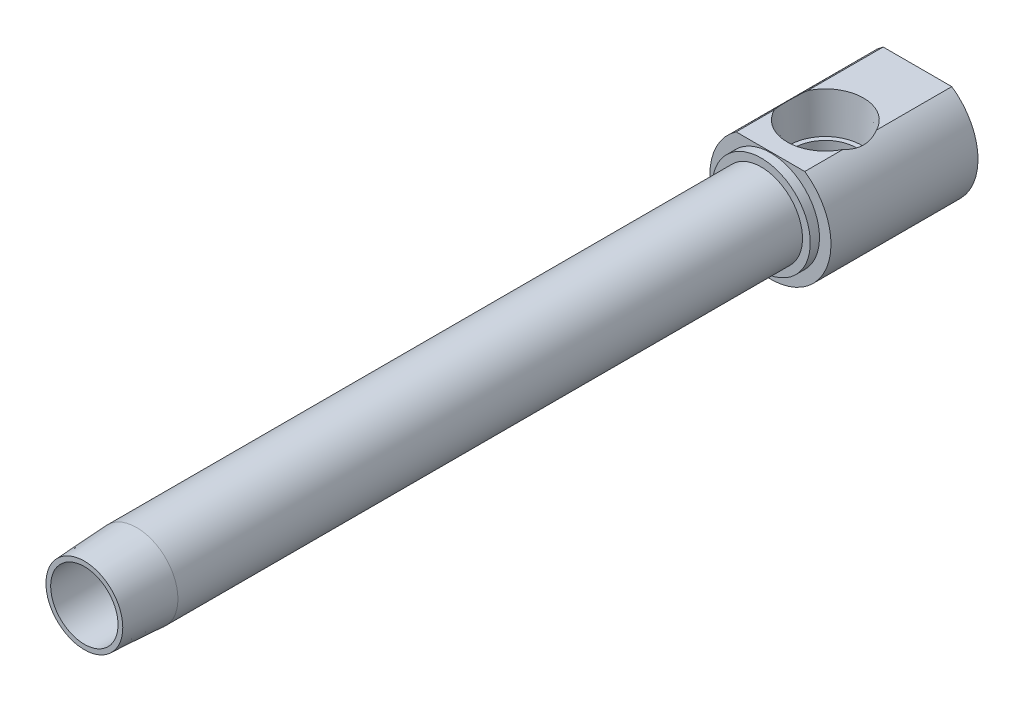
ISO-10303-21;
HEADER;
FILE_DESCRIPTION(('STEP AP214'),'2;1');
FILE_NAME('part.step','',(''),(''),'','','');
FILE_SCHEMA(('AUTOMOTIVE_DESIGN { 1 0 10303 214 1 1 1 1 }'));
ENDSEC;
DATA;
#1=APPLICATION_CONTEXT('core data for automotive mechanical design processes');
#2=APPLICATION_PROTOCOL_DEFINITION('international standard','automotive_design',2000,#1);
#3=PRODUCT_CONTEXT('',#1,'mechanical');
#4=PRODUCT('Part','Part','',(#3));
#5=PRODUCT_RELATED_PRODUCT_CATEGORY('part','',(#4));
#6=PRODUCT_DEFINITION_FORMATION('','',#4);
#7=PRODUCT_DEFINITION_CONTEXT('part definition',#1,'design');
#8=PRODUCT_DEFINITION('design','',#6,#7);
#9=PRODUCT_DEFINITION_SHAPE('','',#8);
#10=(LENGTH_UNIT() NAMED_UNIT(*) SI_UNIT(.MILLI.,.METRE.));
#11=(NAMED_UNIT(*) PLANE_ANGLE_UNIT() SI_UNIT($,.RADIAN.));
#12=(NAMED_UNIT(*) SI_UNIT($,.STERADIAN.) SOLID_ANGLE_UNIT());
#13=UNCERTAINTY_MEASURE_WITH_UNIT(LENGTH_MEASURE(1.E-05),#10,'distance_accuracy_value','');
#14=(GEOMETRIC_REPRESENTATION_CONTEXT(3) GLOBAL_UNCERTAINTY_ASSIGNED_CONTEXT((#13)) GLOBAL_UNIT_ASSIGNED_CONTEXT((#10,
#11,#12)) REPRESENTATION_CONTEXT('',''));
#15=CARTESIAN_POINT('',(0.,0.,0.));
#16=DIRECTION('',(0.,0.,1.));
#17=DIRECTION('',(1.,0.,0.));
#18=AXIS2_PLACEMENT_3D('',#15,#16,#17);
#19=CARTESIAN_POINT('',(0.,0.,-233.947166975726));
#20=DIRECTION('',(0.,0.,-1.));
#21=DIRECTION('',(-1.,0.,0.));
#22=AXIS2_PLACEMENT_3D('',#19,#20,#21);
#23=CYLINDRICAL_SURFACE('',#22,10.6883167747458);
#24=CARTESIAN_POINT('',(0.,0.,-175.4124));
#25=DIRECTION('',(0.,0.,-1.));
#26=DIRECTION('',(-1.,0.,0.));
#27=AXIS2_PLACEMENT_3D('',#24,#25,#26);
#28=CIRCLE('',#27,10.6883167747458);
#29=CARTESIAN_POINT('',(-10.6883167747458,0.,-175.4124));
#30=VERTEX_POINT('',#29);
#31=EDGE_CURVE('E143',#30,#30,#28,.T.);
#32=ORIENTED_EDGE('',*,*,#31,.F.);
#33=EDGE_LOOP('',(#32));
#34=FACE_BOUND('',#33,.T.);
#35=CARTESIAN_POINT('',(0.,0.,-13.5636));
#36=DIRECTION('',(0.,0.,1.));
#37=DIRECTION('',(1.,0.,0.));
#38=AXIS2_PLACEMENT_3D('',#35,#36,#37);
#39=CIRCLE('',#38,10.6883167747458);
#40=CARTESIAN_POINT('',(10.6883167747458,0.,-13.5636));
#41=VERTEX_POINT('',#40);
#42=EDGE_CURVE('E229',#41,#41,#39,.T.);
#43=ORIENTED_EDGE('',*,*,#42,.F.);
#44=EDGE_LOOP('',(#43));
#45=FACE_BOUND('',#44,.T.);
#46=ADVANCED_FACE('F15',(#34,#45),#23,.T.);
#47=CARTESIAN_POINT('',(-8.73125000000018,0.,0.));
#48=DIRECTION('',(0.,0.,1.));
#49=DIRECTION('',(1.,0.,0.));
#50=AXIS2_PLACEMENT_3D('',#47,#48,#49);
#51=PLANE('',#50);
#52=CARTESIAN_POINT('',(0.,0.,0.));
#53=DIRECTION('',(0.,0.,-1.));
#54=DIRECTION('',(-1.,0.,0.));
#55=AXIS2_PLACEMENT_3D('',#52,#53,#54);
#56=CIRCLE('',#55,8.73125000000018);
#57=CARTESIAN_POINT('',(-8.73125000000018,0.,0.));
#58=VERTEX_POINT('',#57);
#59=EDGE_CURVE('E19',#58,#58,#56,.T.);
#60=ORIENTED_EDGE('',*,*,#59,.T.);
#61=EDGE_LOOP('',(#60));
#62=FACE_BOUND('',#61,.T.);
#63=CARTESIAN_POINT('',(0.,0.,0.));
#64=DIRECTION('',(0.,0.,1.));
#65=DIRECTION('',(1.,0.,0.));
#66=AXIS2_PLACEMENT_3D('',#63,#64,#65);
#67=CIRCLE('',#66,9.9568);
#68=CARTESIAN_POINT('',(9.9568,0.,0.));
#69=VERTEX_POINT('',#68);
#70=EDGE_CURVE('E231',#69,#69,#67,.T.);
#71=ORIENTED_EDGE('',*,*,#70,.T.);
#72=EDGE_LOOP('',(#71));
#73=FACE_BOUND('',#72,.T.);
#74=ADVANCED_FACE('F17',(#62,#73),#51,.T.);
#75=CARTESIAN_POINT('',(-8.89,12.9217429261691,-158.75));
#76=DIRECTION('',(0.,-1.,0.));
#77=DIRECTION('',(0.,0.,-1.));
#78=AXIS2_PLACEMENT_3D('',#75,#76,#77);
#79=PLANE('',#78);
#80=DIRECTION('',(0.,0.,-1.));
#81=VECTOR('',#80,1.);
#82=CARTESIAN_POINT('',(8.89,12.9217429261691,-158.75));
#83=LINE('',#82,#81);
#84=CARTESIAN_POINT('',(8.89,12.9217429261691,-177.8));
#85=VERTEX_POINT('',#84);
#86=CARTESIAN_POINT('',(8.89,12.9217429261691,-187.698054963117));
#87=VERTEX_POINT('',#86);
#88=EDGE_CURVE('E127',#85,#87,#83,.T.);
#89=ORIENTED_EDGE('',*,*,#88,.T.);
#90=CARTESIAN_POINT('',(0.,12.9217429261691,-192.024));
#91=DIRECTION('',(0.,-1.,0.));
#92=DIRECTION('',(0.,0.,-1.));
#93=AXIS2_PLACEMENT_3D('',#90,#91,#92);
#94=CIRCLE('',#93,9.88665264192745);
#95=CARTESIAN_POINT('',(-8.89,12.9217429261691,-187.698054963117));
#96=VERTEX_POINT('',#95);
#97=EDGE_CURVE('E111',#87,#96,#94,.T.);
#98=ORIENTED_EDGE('',*,*,#97,.T.);
#99=DIRECTION('',(0.,0.,-1.));
#100=VECTOR('',#99,1.);
#101=CARTESIAN_POINT('',(-8.89,12.9217429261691,-158.75));
#102=LINE('',#101,#100);
#103=CARTESIAN_POINT('',(-8.89,12.9217429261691,-177.8));
#104=VERTEX_POINT('',#103);
#105=EDGE_CURVE('E138',#104,#96,#102,.T.);
#106=ORIENTED_EDGE('',*,*,#105,.F.);
#107=DIRECTION('',(1.,0.,0.));
#108=VECTOR('',#107,1.);
#109=CARTESIAN_POINT('',(-12.7,12.9217429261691,-177.8));
#110=LINE('',#109,#108);
#111=EDGE_CURVE('E135',#104,#85,#110,.T.);
#112=ORIENTED_EDGE('',*,*,#111,.T.);
#113=EDGE_LOOP('',(#89,#98,#106,#112));
#114=FACE_BOUND('',#113,.T.);
#115=ADVANCED_FACE('F133',(#114),#79,.F.);
#116=CARTESIAN_POINT('',(-8.73125000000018,0.,-175.827796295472));
#117=DIRECTION('',(0.,0.,1.));
#118=DIRECTION('',(1.,0.,0.));
#119=AXIS2_PLACEMENT_3D('',#116,#117,#118);
#120=PLANE('',#119);
#121=CARTESIAN_POINT('',(0.,0.,-175.827796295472));
#122=DIRECTION('',(0.,0.,-1.));
#123=DIRECTION('',(-1.,0.,0.));
#124=AXIS2_PLACEMENT_3D('',#121,#122,#123);
#125=CIRCLE('',#124,8.73125000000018);
#126=CARTESIAN_POINT('',(-8.73125000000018,0.,-175.827796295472));
#127=VERTEX_POINT('',#126);
#128=EDGE_CURVE('E157',#127,#127,#125,.T.);
#129=ORIENTED_EDGE('',*,*,#128,.F.);
#130=EDGE_LOOP('',(#129));
#131=FACE_BOUND('',#130,.T.);
#132=CARTESIAN_POINT('',(0.,-1.53831558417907,-175.827796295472));
#133=DIRECTION('',(0.,0.,1.));
#134=DIRECTION('',(0.,1.,0.));
#135=AXIS2_PLACEMENT_3D('',#132,#133,#134);
#136=ELLIPSE('',#135,7.0682508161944,6.80767250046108);
#137=CARTESIAN_POINT('',(0.,5.52993523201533,-175.827796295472));
#138=VERTEX_POINT('',#137);
#139=EDGE_CURVE('E162',#138,#138,#136,.F.);
#140=ORIENTED_EDGE('',*,*,#139,.T.);
#141=EDGE_LOOP('',(#140));
#142=FACE_BOUND('',#141,.T.);
#143=ADVANCED_FACE('F211',(#131,#142),#120,.T.);
#144=CARTESIAN_POINT('',(0.,0.,-233.947166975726));
#145=DIRECTION('',(0.,0.,-1.));
#146=DIRECTION('',(-1.,0.,0.));
#147=AXIS2_PLACEMENT_3D('',#144,#145,#146);
#148=CYLINDRICAL_SURFACE('',#147,8.73125000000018);
#149=ORIENTED_EDGE('',*,*,#128,.T.);
#150=EDGE_LOOP('',(#149));
#151=FACE_BOUND('',#150,.T.);
#152=ORIENTED_EDGE('',*,*,#59,.F.);
#153=EDGE_LOOP('',(#152));
#154=FACE_BOUND('',#153,.T.);
#155=ADVANCED_FACE('F209',(#151,#154),#148,.F.);
#156=CARTESIAN_POINT('',(-15.6845,0.,-215.9));
#157=DIRECTION('',(0.,0.,-1.));
#158=DIRECTION('',(-1.,0.,0.));
#159=AXIS2_PLACEMENT_3D('',#156,#157,#158);
#160=PLANE('',#159);
#161=DIRECTION('',(1.,0.,0.));
#162=VECTOR('',#161,1.);
#163=CARTESIAN_POINT('',(-3.66617420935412,6.35,-215.9));
#164=LINE('',#163,#162);
#165=CARTESIAN_POINT('',(-3.66617420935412,6.35,-215.9));
#166=VERTEX_POINT('',#165);
#167=CARTESIAN_POINT('',(3.66617420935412,6.35,-215.9));
#168=VERTEX_POINT('',#167);
#169=EDGE_CURVE('E165',#166,#168,#164,.T.);
#170=ORIENTED_EDGE('',*,*,#169,.F.);
#171=DIRECTION('',(0.5,0.866025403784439,0.));
#172=VECTOR('',#171,1.);
#173=CARTESIAN_POINT('',(-7.33234841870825,0.,-215.9));
#174=LINE('',#173,#172);
#175=CARTESIAN_POINT('',(-7.33234841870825,0.,-215.9));
#176=VERTEX_POINT('',#175);
#177=EDGE_CURVE('E284',#176,#166,#174,.T.);
#178=ORIENTED_EDGE('',*,*,#177,.F.);
#179=DIRECTION('',(-0.5,0.866025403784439,0.));
#180=VECTOR('',#179,1.);
#181=CARTESIAN_POINT('',(-3.66617420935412,-6.35,-215.9));
#182=LINE('',#181,#180);
#183=CARTESIAN_POINT('',(-3.66617420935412,-6.35,-215.9));
#184=VERTEX_POINT('',#183);
#185=EDGE_CURVE('E310',#184,#176,#182,.T.);
#186=ORIENTED_EDGE('',*,*,#185,.F.);
#187=DIRECTION('',(-1.,0.,0.));
#188=VECTOR('',#187,1.);
#189=CARTESIAN_POINT('',(3.66617420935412,-6.35,-215.9));
#190=LINE('',#189,#188);
#191=CARTESIAN_POINT('',(3.66617420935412,-6.35,-215.9));
#192=VERTEX_POINT('',#191);
#193=EDGE_CURVE('E307',#192,#184,#190,.T.);
#194=ORIENTED_EDGE('',*,*,#193,.F.);
#195=DIRECTION('',(-0.5,-0.866025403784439,0.));
#196=VECTOR('',#195,1.);
#197=CARTESIAN_POINT('',(7.33234841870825,0.,-215.9));
#198=LINE('',#197,#196);
#199=CARTESIAN_POINT('',(7.33234841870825,0.,-215.9));
#200=VERTEX_POINT('',#199);
#201=EDGE_CURVE('E304',#200,#192,#198,.T.);
#202=ORIENTED_EDGE('',*,*,#201,.F.);
#203=DIRECTION('',(0.5,-0.866025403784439,0.));
#204=VECTOR('',#203,1.);
#205=CARTESIAN_POINT('',(3.66617420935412,6.35,-215.9));
#206=LINE('',#205,#204);
#207=EDGE_CURVE('E301',#168,#200,#206,.T.);
#208=ORIENTED_EDGE('',*,*,#207,.F.);
#209=EDGE_LOOP('',(#170,#178,#186,#194,#202,#208));
#210=FACE_BOUND('',#209,.T.);
#211=DIRECTION('',(-1.,0.,0.));
#212=VECTOR('',#211,1.);
#213=CARTESIAN_POINT('',(-8.89,12.9217429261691,-215.9));
#214=LINE('',#213,#212);
#215=CARTESIAN_POINT('',(8.89,12.9217429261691,-215.9));
#216=VERTEX_POINT('',#215);
#217=CARTESIAN_POINT('',(-8.89,12.9217429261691,-215.9));
#218=VERTEX_POINT('',#217);
#219=EDGE_CURVE('E140',#216,#218,#214,.T.);
#220=ORIENTED_EDGE('',*,*,#219,.F.);
#221=CARTESIAN_POINT('',(0.,0.,-215.9));
#222=DIRECTION('',(0.,0.,-1.));
#223=DIRECTION('',(-1.,0.,0.));
#224=AXIS2_PLACEMENT_3D('',#221,#222,#223);
#225=CIRCLE('',#224,15.6845);
#226=EDGE_CURVE('E154',#216,#218,#225,.T.);
#227=ORIENTED_EDGE('',*,*,#226,.T.);
#228=EDGE_LOOP('',(#220,#227));
#229=FACE_BOUND('',#228,.T.);
#230=ADVANCED_FACE('F204',(#210,#229),#160,.T.);
#231=CARTESIAN_POINT('',(0.,0.,-233.947166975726));
#232=DIRECTION('',(0.,0.,-1.));
#233=DIRECTION('',(-1.,0.,0.));
#234=AXIS2_PLACEMENT_3D('',#231,#232,#233);
#235=CYLINDRICAL_SURFACE('',#234,15.6845);
#236=CARTESIAN_POINT('',(6.18126199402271,14.4151149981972,-184.207890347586));
#237=CARTESIAN_POINT('',(6.40820210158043,14.317827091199,-184.393892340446));
#238=CARTESIAN_POINT('',(6.6261718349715,14.2179923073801,-184.589429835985));
#239=CARTESIAN_POINT('',(7.04356392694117,14.015896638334,-184.998561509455));
#240=CARTESIAN_POINT('',(7.24297338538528,13.9136341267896,-185.212168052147));
#241=CARTESIAN_POINT('',(7.62085258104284,13.7102837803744,-185.654442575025));
#242=CARTESIAN_POINT('',(7.7994726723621,13.6091929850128,-185.882980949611));
#243=CARTESIAN_POINT('',(8.13667540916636,13.4103063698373,-186.355534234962));
#244=CARTESIAN_POINT('',(8.29527210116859,13.3125082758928,-186.599538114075));
#245=CARTESIAN_POINT('',(8.52405372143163,13.1663669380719,-186.987604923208));
#246=CARTESIAN_POINT('',(8.60159506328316,13.1157948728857,-187.126544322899));
#247=CARTESIAN_POINT('',(8.7504241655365,13.0169736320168,-187.408789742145));
#248=CARTESIAN_POINT('',(8.82170394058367,12.9687274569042,-187.55210103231));
#249=CARTESIAN_POINT('',(8.98942344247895,12.85334420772,-187.910530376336));
#250=CARTESIAN_POINT('',(9.08209775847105,12.7878879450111,-188.127972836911));
#251=CARTESIAN_POINT('',(9.25265845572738,12.6650269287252,-188.570791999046));
#252=CARTESIAN_POINT('',(9.33054529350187,12.6076219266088,-188.796168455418));
#253=CARTESIAN_POINT('',(9.47086217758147,12.5025600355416,-189.254136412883));
#254=CARTESIAN_POINT('',(9.53327990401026,12.4549109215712,-189.486733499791));
#255=CARTESIAN_POINT('',(9.64181076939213,12.3710847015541,-189.957621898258));
#256=CARTESIAN_POINT('',(9.68793245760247,12.3349015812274,-190.195910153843));
#257=CARTESIAN_POINT('',(9.76349281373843,12.2751820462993,-190.678204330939));
#258=CARTESIAN_POINT('',(9.79282896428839,12.2517233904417,-190.922236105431));
#259=CARTESIAN_POINT('',(9.83390591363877,12.2187780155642,-191.412731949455));
#260=CARTESIAN_POINT('',(9.84564637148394,12.2092915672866,-191.659196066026));
#261=CARTESIAN_POINT('',(9.85132494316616,12.2047101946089,-192.152460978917));
#262=CARTESIAN_POINT('',(9.84526326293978,12.2096151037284,-192.399261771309));
#263=CARTESIAN_POINT('',(9.81544491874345,12.2335989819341,-192.891077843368));
#264=CARTESIAN_POINT('',(9.79168936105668,12.2526770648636,-193.136093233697));
#265=CARTESIAN_POINT('',(9.7294701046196,12.3021291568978,-193.603007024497));
#266=CARTESIAN_POINT('',(9.69232783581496,12.3314830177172,-193.825192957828));
#267=CARTESIAN_POINT('',(9.60385268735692,12.400512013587,-194.265181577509));
#268=CARTESIAN_POINT('',(9.55251354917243,12.4401917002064,-194.482982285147));
#269=CARTESIAN_POINT('',(9.43631194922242,12.5285621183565,-194.912660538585));
#270=CARTESIAN_POINT('',(9.37147123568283,12.5772383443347,-195.124546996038));
#271=CARTESIAN_POINT('',(9.22879623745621,12.6822986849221,-195.541936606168));
#272=CARTESIAN_POINT('',(9.1509619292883,12.7386828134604,-195.747439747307));
#273=CARTESIAN_POINT('',(9.01061877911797,12.838109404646,-196.084726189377));
#274=CARTESIAN_POINT('',(8.95152353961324,12.8794177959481,-196.218466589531));
#275=CARTESIAN_POINT('',(8.76461266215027,13.0080031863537,-196.617903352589));
#276=CARTESIAN_POINT('',(8.62838014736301,13.0990466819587,-196.878521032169));
#277=CARTESIAN_POINT('',(8.33484719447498,13.2877507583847,-197.385122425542));
#278=CARTESIAN_POINT('',(8.17753852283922,13.385413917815,-197.631100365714));
#279=CARTESIAN_POINT('',(7.84238437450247,13.5844995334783,-198.1080815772));
#280=CARTESIAN_POINT('',(7.66448703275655,13.685931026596,-198.339044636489));
#281=CARTESIAN_POINT('',(7.28939666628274,13.8893391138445,-198.784214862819));
#282=CARTESIAN_POINT('',(7.09221474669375,13.9913153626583,-198.998431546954));
#283=CARTESIAN_POINT('',(6.68803601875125,14.1888008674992,-199.400395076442));
#284=CARTESIAN_POINT('',(6.48182024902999,14.2844001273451,-199.588882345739));
#285=CARTESIAN_POINT('',(6.05384699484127,14.4709681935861,-199.947789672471));
#286=CARTESIAN_POINT('',(5.83215453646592,14.5619538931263,-200.118278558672));
#287=CARTESIAN_POINT('',(5.60267382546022,14.6496957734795,-200.279590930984));
#288=B_SPLINE_CURVE_WITH_KNOTS('',3,(#236,#237,#238,#239,#240,#241,#242,#243,#244,#245,#246,
#247,#248,#249,#250,#251,#252,#253,#254,#255,#256,#257,#258,#259,#260,#261,#262,#263,#264,#265,
#266,#267,#268,#269,#270,#271,#272,#273,#274,#275,#276,#277,#278,#279,#280,#281,#282,#283,#284,
#285,#286,#287),.UNSPECIFIED.,.F.,.F.,(4,2,2,2,2,2,2,2,2,2,2,2,2,2,2,2,2,2,2,2,2,2,2,2,2,4),(0.,
0.927053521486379,1.85474664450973,2.77524763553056,3.69509925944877,4.1958032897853,
4.69713686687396,5.43222687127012,6.16729417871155,6.90294503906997,7.63820938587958,
8.37791768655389,9.11764032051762,9.85735439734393,10.5970222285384,11.2778067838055,
11.9588919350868,12.6388883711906,13.3188860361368,13.7745816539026,14.696795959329,
15.6193715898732,16.5443240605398,17.4687469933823,18.3536130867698,19.2349623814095),.UNSPECIFIED.);
#289=CARTESIAN_POINT('',(8.89,12.9217429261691,-196.349945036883));
#290=VERTEX_POINT('',#289);
#291=EDGE_CURVE('E31',#87,#290,#288,.T.);
#292=ORIENTED_EDGE('',*,*,#291,.F.);
#293=ORIENTED_EDGE('',*,*,#88,.F.);
#294=CARTESIAN_POINT('',(0.,0.,-177.8));
#295=DIRECTION('',(0.,0.,-1.));
#296=DIRECTION('',(-1.,0.,0.));
#297=AXIS2_PLACEMENT_3D('',#294,#295,#296);
#298=CIRCLE('',#297,15.6845);
#299=EDGE_CURVE('E152',#85,#104,#298,.T.);
#300=ORIENTED_EDGE('',*,*,#299,.T.);
#301=ORIENTED_EDGE('',*,*,#105,.T.);
#302=CARTESIAN_POINT('',(-5.60267382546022,14.6496957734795,-200.279590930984));
#303=CARTESIAN_POINT('',(-5.83916916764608,14.5592741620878,-200.113346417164));
#304=CARTESIAN_POINT('',(-6.06739391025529,14.4654038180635,-199.937356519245));
#305=CARTESIAN_POINT('',(-6.50657666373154,14.2732361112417,-199.567106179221));
#306=CARTESIAN_POINT('',(-6.71753229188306,14.1749381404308,-199.372843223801));
#307=CARTESIAN_POINT('',(-7.12045557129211,13.9768691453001,-198.96824748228));
#308=CARTESIAN_POINT('',(-7.31250621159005,13.8771069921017,-198.757992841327));
#309=CARTESIAN_POINT('',(-7.67797599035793,13.6782845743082,-198.321703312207));
#310=CARTESIAN_POINT('',(-7.851401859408,13.5792240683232,-198.095674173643));
#311=CARTESIAN_POINT('',(-8.18139016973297,13.3830412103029,-197.625173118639));
#312=CARTESIAN_POINT('',(-8.3376630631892,13.2859696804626,-197.380476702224));
#313=CARTESIAN_POINT('',(-8.62954581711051,13.0982677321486,-196.876292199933));
#314=CARTESIAN_POINT('',(-8.76513502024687,13.0076438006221,-196.616789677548));
#315=CARTESIAN_POINT('',(-8.98947377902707,12.8533099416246,-196.137363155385));
#316=CARTESIAN_POINT('',(-9.08217383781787,12.7878343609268,-195.919849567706));
#317=CARTESIAN_POINT('',(-9.25276992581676,12.6649454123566,-195.476898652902));
#318=CARTESIAN_POINT('',(-9.33066889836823,12.6075304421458,-195.251462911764));
#319=CARTESIAN_POINT('',(-9.47096094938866,12.5024850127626,-194.793506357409));
#320=CARTESIAN_POINT('',(-9.53335030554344,12.4548569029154,-194.56098385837));
#321=CARTESIAN_POINT('',(-9.64183755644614,12.3710636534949,-194.090239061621));
#322=CARTESIAN_POINT('',(-9.68794342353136,12.3348929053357,-193.852019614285));
#323=CARTESIAN_POINT('',(-9.76349062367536,12.2751837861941,-193.369809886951));
#324=CARTESIAN_POINT('',(-9.79282550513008,12.2517261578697,-193.125792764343));
#325=CARTESIAN_POINT('',(-9.83390185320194,12.2187812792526,-192.635328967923));
#326=CARTESIAN_POINT('',(-9.84564316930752,12.2092941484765,-192.388882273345));
#327=CARTESIAN_POINT('',(-9.85132631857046,12.2047090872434,-191.895619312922));
#328=CARTESIAN_POINT('',(-9.84526600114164,12.2096128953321,-191.648803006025));
#329=CARTESIAN_POINT('',(-9.81544809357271,12.2335964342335,-191.156954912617));
#330=CARTESIAN_POINT('',(-9.79169153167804,12.2526753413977,-190.911923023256));
#331=CARTESIAN_POINT('',(-9.72947134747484,12.3021281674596,-190.445002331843));
#332=CARTESIAN_POINT('',(-9.69233092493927,12.3314805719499,-190.222825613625));
#333=CARTESIAN_POINT('',(-9.60386128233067,12.4005053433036,-189.782857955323));
#334=CARTESIAN_POINT('',(-9.55252598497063,12.4401821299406,-189.5650689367));
#335=CARTESIAN_POINT('',(-9.43632738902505,12.5285504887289,-189.13539132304));
#336=CARTESIAN_POINT('',(-9.37148448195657,12.5772284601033,-188.923494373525));
#337=CARTESIAN_POINT('',(-9.22880457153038,12.6822926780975,-188.506085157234));
#338=CARTESIAN_POINT('',(-9.15096746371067,12.7386789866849,-188.300572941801));
#339=CARTESIAN_POINT('',(-9.01061796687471,12.8381099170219,-187.963272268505));
#340=CARTESIAN_POINT('',(-8.95152097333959,12.8794194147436,-187.829528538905));
#341=CARTESIAN_POINT('',(-8.80068775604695,12.9831855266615,-187.507189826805));
#342=CARTESIAN_POINT('',(-8.70603543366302,13.0469462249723,-187.320366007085));
#343=CARTESIAN_POINT('',(-8.50583150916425,13.1783430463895,-186.953845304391));
#344=CARTESIAN_POINT('',(-8.40026939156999,13.2459828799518,-186.774155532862));
#345=CARTESIAN_POINT('',(-8.14693598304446,13.403699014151,-186.372018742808));
#346=CARTESIAN_POINT('',(-7.99573471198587,13.4946529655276,-186.152065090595));
#347=CARTESIAN_POINT('',(-7.67663330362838,13.6786987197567,-185.725415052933));
#348=CARTESIAN_POINT('',(-7.50872479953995,13.7717915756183,-185.518725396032));
#349=CARTESIAN_POINT('',(-7.15655125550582,13.9580450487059,-185.119106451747));
#350=CARTESIAN_POINT('',(-6.97225920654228,14.0512055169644,-184.926200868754));
#351=CARTESIAN_POINT('',(-6.58822039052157,14.2353204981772,-184.555512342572));
#352=CARTESIAN_POINT('',(-6.38848080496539,14.3262760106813,-184.377722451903));
#353=CARTESIAN_POINT('',(-6.18126199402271,14.4151149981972,-184.207890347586));
#354=B_SPLINE_CURVE_WITH_KNOTS('',3,(#302,#303,#304,#305,#306,#307,#308,#309,#310,#311,#312,
#313,#314,#315,#316,#317,#318,#319,#320,#321,#322,#323,#324,#325,#326,#327,#328,#329,#330,#331,
#332,#333,#334,#335,#336,#337,#338,#339,#340,#341,#342,#343,#344,#345,#346,#347,#348,#349,#350,
#351,#352,#353),.UNSPECIFIED.,.F.,.F.,(4,2,2,2,2,2,2,2,2,2,2,2,2,2,2,2,2,2,2,2,2,2,2,2,2,4),(0.,
0.908274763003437,1.81667463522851,2.72089010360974,3.62477770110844,4.54212421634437,
5.46038099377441,6.1957609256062,6.93099446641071,7.66640429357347,8.40145356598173,
9.14111809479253,9.88078895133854,10.6205491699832,11.3602664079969,12.0410224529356,
12.7220704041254,13.4020975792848,14.0821302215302,14.5378258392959,15.1941212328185,
15.8510552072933,16.6961350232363,17.5416401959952,18.388566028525,19.2351004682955),.UNSPECIFIED.);
#355=CARTESIAN_POINT('',(-8.89,12.9217429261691,-196.349945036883));
#356=VERTEX_POINT('',#355);
#357=EDGE_CURVE('E115',#356,#96,#354,.T.);
#358=ORIENTED_EDGE('',*,*,#357,.F.);
#359=EDGE_CURVE('E136',#356,#218,#102,.T.);
#360=ORIENTED_EDGE('',*,*,#359,.T.);
#361=ORIENTED_EDGE('',*,*,#226,.F.);
#362=EDGE_CURVE('E130',#290,#216,#83,.T.);
#363=ORIENTED_EDGE('',*,*,#362,.F.);
#364=EDGE_LOOP('',(#292,#293,#300,#301,#358,#360,#361,#363));
#365=FACE_BOUND('',#364,.T.);
#366=ADVANCED_FACE('F125',(#365),#235,.T.);
#367=CARTESIAN_POINT('',(-12.7,0.,-177.8));
#368=DIRECTION('',(0.,0.,1.));
#369=DIRECTION('',(1.,0.,0.));
#370=AXIS2_PLACEMENT_3D('',#367,#368,#369);
#371=PLANE('',#370);
#372=ORIENTED_EDGE('',*,*,#111,.F.);
#373=ORIENTED_EDGE('',*,*,#299,.F.);
#374=EDGE_LOOP('',(#372,#373));
#375=FACE_BOUND('',#374,.T.);
#376=CARTESIAN_POINT('',(0.,0.,-177.8));
#377=DIRECTION('',(0.,0.,-1.));
#378=DIRECTION('',(-1.,0.,0.));
#379=AXIS2_PLACEMENT_3D('',#376,#377,#378);
#380=CIRCLE('',#379,12.7);
#381=CARTESIAN_POINT('',(-12.7,0.,-177.8));
#382=VERTEX_POINT('',#381);
#383=EDGE_CURVE('E149',#382,#382,#380,.T.);
#384=ORIENTED_EDGE('',*,*,#383,.T.);
#385=EDGE_LOOP('',(#384));
#386=FACE_BOUND('',#385,.T.);
#387=ADVANCED_FACE('F203',(#375,#386),#371,.T.);
#388=CARTESIAN_POINT('',(0.,0.,-233.947166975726));
#389=DIRECTION('',(0.,0.,-1.));
#390=DIRECTION('',(-1.,0.,0.));
#391=AXIS2_PLACEMENT_3D('',#388,#389,#390);
#392=CYLINDRICAL_SURFACE('',#391,12.7);
#393=CARTESIAN_POINT('',(0.,0.,-175.4124));
#394=DIRECTION('',(0.,0.,-1.));
#395=DIRECTION('',(-1.,0.,0.));
#396=AXIS2_PLACEMENT_3D('',#393,#394,#395);
#397=CIRCLE('',#396,12.7);
#398=CARTESIAN_POINT('',(-12.7,0.,-175.4124));
#399=VERTEX_POINT('',#398);
#400=EDGE_CURVE('E146',#399,#399,#397,.T.);
#401=ORIENTED_EDGE('',*,*,#400,.T.);
#402=EDGE_LOOP('',(#401));
#403=FACE_BOUND('',#402,.T.);
#404=ORIENTED_EDGE('',*,*,#383,.F.);
#405=EDGE_LOOP('',(#404));
#406=FACE_BOUND('',#405,.T.);
#407=ADVANCED_FACE('F335',(#403,#406),#392,.T.);
#408=CARTESIAN_POINT('',(-10.6883167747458,0.,-175.4124));
#409=DIRECTION('',(0.,0.,1.));
#410=DIRECTION('',(1.,0.,0.));
#411=AXIS2_PLACEMENT_3D('',#408,#409,#410);
#412=PLANE('',#411);
#413=ORIENTED_EDGE('',*,*,#31,.T.);
#414=EDGE_LOOP('',(#413));
#415=FACE_BOUND('',#414,.T.);
#416=ORIENTED_EDGE('',*,*,#400,.F.);
#417=EDGE_LOOP('',(#416));
#418=FACE_BOUND('',#417,.T.);
#419=ADVANCED_FACE('F339',(#415,#418),#412,.T.);
#420=ORIENTED_EDGE('',*,*,#359,.F.);
#421=EDGE_CURVE('E120',#356,#290,#94,.T.);
#422=ORIENTED_EDGE('',*,*,#421,.T.);
#423=ORIENTED_EDGE('',*,*,#362,.T.);
#424=ORIENTED_EDGE('',*,*,#219,.T.);
#425=EDGE_LOOP('',(#420,#422,#423,#424));
#426=FACE_BOUND('',#425,.T.);
#427=ADVANCED_FACE('F330',(#426),#79,.F.);
#428=CARTESIAN_POINT('',(-3.66617420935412,6.35,-209.55));
#429=DIRECTION('',(0.,1.,0.));
#430=DIRECTION('',(-1.,0.,0.));
#431=AXIS2_PLACEMENT_3D('',#428,#429,#430);
#432=PLANE('',#431);
#433=ORIENTED_EDGE('',*,*,#169,.T.);
#434=DIRECTION('',(0.,0.,-1.));
#435=VECTOR('',#434,1.);
#436=CARTESIAN_POINT('',(3.66617420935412,6.35,-209.55));
#437=LINE('',#436,#435);
#438=CARTESIAN_POINT('',(3.66617420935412,6.35,-209.55));
#439=VERTEX_POINT('',#438);
#440=EDGE_CURVE('E299',#439,#168,#437,.T.);
#441=ORIENTED_EDGE('',*,*,#440,.F.);
#442=DIRECTION('',(1.,0.,0.));
#443=VECTOR('',#442,1.);
#444=CARTESIAN_POINT('',(-3.66617420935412,6.35,-209.55));
#445=LINE('',#444,#443);
#446=CARTESIAN_POINT('',(-3.66617420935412,6.35,-209.55));
#447=VERTEX_POINT('',#446);
#448=EDGE_CURVE('E280',#447,#439,#445,.T.);
#449=ORIENTED_EDGE('',*,*,#448,.F.);
#450=DIRECTION('',(0.,0.,-1.));
#451=VECTOR('',#450,1.);
#452=CARTESIAN_POINT('',(-3.66617420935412,6.35,-209.55));
#453=LINE('',#452,#451);
#454=EDGE_CURVE('E315',#447,#166,#453,.T.);
#455=ORIENTED_EDGE('',*,*,#454,.T.);
#456=EDGE_LOOP('',(#433,#441,#449,#455));
#457=FACE_BOUND('',#456,.T.);
#458=ADVANCED_FACE('F350',(#457),#432,.F.);
#459=CARTESIAN_POINT('',(-7.33234841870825,0.,-209.55));
#460=DIRECTION('',(-0.866025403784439,0.5,0.));
#461=DIRECTION('',(-0.5,-0.866025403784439,0.));
#462=AXIS2_PLACEMENT_3D('',#459,#460,#461);
#463=PLANE('',#462);
#464=ORIENTED_EDGE('',*,*,#177,.T.);
#465=ORIENTED_EDGE('',*,*,#454,.F.);
#466=DIRECTION('',(0.5,0.866025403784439,0.));
#467=VECTOR('',#466,1.);
#468=CARTESIAN_POINT('',(-7.33234841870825,0.,-209.55));
#469=LINE('',#468,#467);
#470=CARTESIAN_POINT('',(-7.33234841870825,0.,-209.55));
#471=VERTEX_POINT('',#470);
#472=EDGE_CURVE('E296',#471,#447,#469,.T.);
#473=ORIENTED_EDGE('',*,*,#472,.F.);
#474=DIRECTION('',(0.,0.,-1.));
#475=VECTOR('',#474,1.);
#476=CARTESIAN_POINT('',(-7.33234841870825,0.,-209.55));
#477=LINE('',#476,#475);
#478=EDGE_CURVE('E317',#471,#176,#477,.T.);
#479=ORIENTED_EDGE('',*,*,#478,.T.);
#480=EDGE_LOOP('',(#464,#465,#473,#479));
#481=FACE_BOUND('',#480,.T.);
#482=ADVANCED_FACE('F353',(#481),#463,.F.);
#483=CARTESIAN_POINT('',(-3.66617420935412,-6.35,-209.55));
#484=DIRECTION('',(-0.866025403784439,-0.5,0.));
#485=DIRECTION('',(0.5,-0.866025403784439,0.));
#486=AXIS2_PLACEMENT_3D('',#483,#484,#485);
#487=PLANE('',#486);
#488=ORIENTED_EDGE('',*,*,#185,.T.);
#489=ORIENTED_EDGE('',*,*,#478,.F.);
#490=DIRECTION('',(-0.5,0.866025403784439,0.));
#491=VECTOR('',#490,1.);
#492=CARTESIAN_POINT('',(-3.66617420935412,-6.35,-209.55));
#493=LINE('',#492,#491);
#494=CARTESIAN_POINT('',(-3.66617420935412,-6.35,-209.55));
#495=VERTEX_POINT('',#494);
#496=EDGE_CURVE('E293',#495,#471,#493,.T.);
#497=ORIENTED_EDGE('',*,*,#496,.F.);
#498=DIRECTION('',(0.,0.,-1.));
#499=VECTOR('',#498,1.);
#500=CARTESIAN_POINT('',(-3.66617420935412,-6.35,-209.55));
#501=LINE('',#500,#499);
#502=EDGE_CURVE('E319',#495,#184,#501,.T.);
#503=ORIENTED_EDGE('',*,*,#502,.T.);
#504=EDGE_LOOP('',(#488,#489,#497,#503));
#505=FACE_BOUND('',#504,.T.);
#506=ADVANCED_FACE('F367',(#505),#487,.F.);
#507=CARTESIAN_POINT('',(3.66617420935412,-6.35,-209.55));
#508=DIRECTION('',(0.,-1.,0.));
#509=DIRECTION('',(1.,0.,0.));
#510=AXIS2_PLACEMENT_3D('',#507,#508,#509);
#511=PLANE('',#510);
#512=ORIENTED_EDGE('',*,*,#193,.T.);
#513=ORIENTED_EDGE('',*,*,#502,.F.);
#514=DIRECTION('',(-1.,0.,0.));
#515=VECTOR('',#514,1.);
#516=CARTESIAN_POINT('',(3.66617420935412,-6.35,-209.55));
#517=LINE('',#516,#515);
#518=CARTESIAN_POINT('',(3.66617420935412,-6.35,-209.55));
#519=VERTEX_POINT('',#518);
#520=EDGE_CURVE('E290',#519,#495,#517,.T.);
#521=ORIENTED_EDGE('',*,*,#520,.F.);
#522=DIRECTION('',(0.,0.,-1.));
#523=VECTOR('',#522,1.);
#524=CARTESIAN_POINT('',(3.66617420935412,-6.35,-209.55));
#525=LINE('',#524,#523);
#526=EDGE_CURVE('E321',#519,#192,#525,.T.);
#527=ORIENTED_EDGE('',*,*,#526,.T.);
#528=EDGE_LOOP('',(#512,#513,#521,#527));
#529=FACE_BOUND('',#528,.T.);
#530=ADVANCED_FACE('F363',(#529),#511,.F.);
#531=CARTESIAN_POINT('',(7.33234841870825,0.,-209.55));
#532=DIRECTION('',(0.866025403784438,-0.5,0.));
#533=DIRECTION('',(0.5,0.866025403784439,0.));
#534=AXIS2_PLACEMENT_3D('',#531,#532,#533);
#535=PLANE('',#534);
#536=ORIENTED_EDGE('',*,*,#201,.T.);
#537=ORIENTED_EDGE('',*,*,#526,.F.);
#538=DIRECTION('',(-0.5,-0.866025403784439,0.));
#539=VECTOR('',#538,1.);
#540=CARTESIAN_POINT('',(7.33234841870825,0.,-209.55));
#541=LINE('',#540,#539);
#542=CARTESIAN_POINT('',(7.33234841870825,0.,-209.55));
#543=VERTEX_POINT('',#542);
#544=EDGE_CURVE('E287',#543,#519,#541,.T.);
#545=ORIENTED_EDGE('',*,*,#544,.F.);
#546=DIRECTION('',(0.,0.,-1.));
#547=VECTOR('',#546,1.);
#548=CARTESIAN_POINT('',(7.33234841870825,0.,-209.55));
#549=LINE('',#548,#547);
#550=EDGE_CURVE('E323',#543,#200,#549,.T.);
#551=ORIENTED_EDGE('',*,*,#550,.T.);
#552=EDGE_LOOP('',(#536,#537,#545,#551));
#553=FACE_BOUND('',#552,.T.);
#554=ADVANCED_FACE('F359',(#553),#535,.F.);
#555=CARTESIAN_POINT('',(3.66617420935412,6.35,-209.55));
#556=DIRECTION('',(0.866025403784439,0.5,0.));
#557=DIRECTION('',(-0.5,0.866025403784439,0.));
#558=AXIS2_PLACEMENT_3D('',#555,#556,#557);
#559=PLANE('',#558);
#560=ORIENTED_EDGE('',*,*,#207,.T.);
#561=ORIENTED_EDGE('',*,*,#550,.F.);
#562=DIRECTION('',(0.5,-0.866025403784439,0.));
#563=VECTOR('',#562,1.);
#564=CARTESIAN_POINT('',(3.66617420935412,6.35,-209.55));
#565=LINE('',#564,#563);
#566=EDGE_CURVE('E283',#439,#543,#565,.T.);
#567=ORIENTED_EDGE('',*,*,#566,.F.);
#568=ORIENTED_EDGE('',*,*,#440,.T.);
#569=EDGE_LOOP('',(#560,#561,#567,#568));
#570=FACE_BOUND('',#569,.T.);
#571=ADVANCED_FACE('F355',(#570),#559,.F.);
#572=CARTESIAN_POINT('',(0.,0.,-209.55));
#573=DIRECTION('',(0.,0.,-1.));
#574=DIRECTION('',(-1.,0.,0.));
#575=AXIS2_PLACEMENT_3D('',#572,#573,#574);
#576=PLANE('',#575);
#577=ORIENTED_EDGE('',*,*,#448,.T.);
#578=ORIENTED_EDGE('',*,*,#566,.T.);
#579=ORIENTED_EDGE('',*,*,#544,.T.);
#580=ORIENTED_EDGE('',*,*,#520,.T.);
#581=ORIENTED_EDGE('',*,*,#496,.T.);
#582=ORIENTED_EDGE('',*,*,#472,.T.);
#583=EDGE_LOOP('',(#577,#578,#579,#580,#581,#582));
#584=FACE_BOUND('',#583,.T.);
#585=ADVANCED_FACE('F358',(#584),#576,.T.);
#586=CARTESIAN_POINT('',(0.,-6.16022605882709,-191.684880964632));
#587=DIRECTION('',(0.,0.267292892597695,0.963615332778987));
#588=DIRECTION('',(0.,-0.963615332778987,0.267292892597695));
#589=AXIS2_PLACEMENT_3D('',#586,#587,#588);
#590=CONICAL_SURFACE('',#589,4.92936747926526,0.794181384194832);
#591=CARTESIAN_POINT('',(-4.92956747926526,-6.70529941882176,-191.499424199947));
#592=CARTESIAN_POINT('',(-4.86454849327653,-6.74578087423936,-191.551070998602));
#593=CARTESIAN_POINT('',(-4.79934438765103,-6.7860241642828,-191.602671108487));
#594=CARTESIAN_POINT('',(-4.66853190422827,-6.86595614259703,-191.705790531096));
#595=CARTESIAN_POINT('',(-4.60292352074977,-6.90564482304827,-191.757309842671));
#596=CARTESIAN_POINT('',(-4.40534693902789,-7.02381768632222,-191.911838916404));
#597=CARTESIAN_POINT('',(-4.27272274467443,-7.1013489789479,-192.01474396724));
#598=CARTESIAN_POINT('',(-4.00251092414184,-7.25460162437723,-192.222758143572));
#599=CARTESIAN_POINT('',(-3.86487828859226,-7.33024565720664,-192.327865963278));
#600=CARTESIAN_POINT('',(-3.58724919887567,-7.47631067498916,-192.538527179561));
#601=CARTESIAN_POINT('',(-3.44725356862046,-7.54673343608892,-192.644080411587));
#602=CARTESIAN_POINT('',(-3.21819876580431,-7.65449614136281,-192.816695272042));
#603=CARTESIAN_POINT('',(-3.12989166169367,-7.6942780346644,-192.883222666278));
#604=CARTESIAN_POINT('',(-2.95246158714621,-7.76968051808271,-193.017521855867));
#605=CARTESIAN_POINT('',(-2.86333881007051,-7.80530206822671,-193.085293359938));
#606=CARTESIAN_POINT('',(-2.68510954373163,-7.87069033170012,-193.222592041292));
#607=CARTESIAN_POINT('',(-2.59600565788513,-7.90048815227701,-193.292107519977));
#608=CARTESIAN_POINT('',(-2.41819352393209,-7.95229207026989,-193.4345042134));
#609=CARTESIAN_POINT('',(-2.32948506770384,-7.97430290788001,-193.507383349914));
#610=CARTESIAN_POINT('',(-2.18125639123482,-8.00258021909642,-193.634777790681));
#611=CARTESIAN_POINT('',(-2.1211797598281,-8.01160947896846,-193.68801645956));
#612=CARTESIAN_POINT('',(-2.002934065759,-8.02367996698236,-193.797228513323));
#613=CARTESIAN_POINT('',(-1.94476433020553,-8.02672333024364,-193.853200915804));
#614=CARTESIAN_POINT('',(-1.83159633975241,-8.02621720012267,-193.967693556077));
#615=CARTESIAN_POINT('',(-1.77658330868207,-8.0227015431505,-194.026199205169));
#616=CARTESIAN_POINT('',(-1.67018669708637,-8.009162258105,-194.145693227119));
#617=CARTESIAN_POINT('',(-1.61880314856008,-7.99913857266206,-194.206681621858));
#618=CARTESIAN_POINT('',(-1.50977573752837,-7.97060670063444,-194.343214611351));
#619=CARTESIAN_POINT('',(-1.45300970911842,-7.95077990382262,-194.419178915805));
#620=CARTESIAN_POINT('',(-1.34440201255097,-7.90455613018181,-194.572638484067));
#621=CARTESIAN_POINT('',(-1.29256550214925,-7.8781523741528,-194.650135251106));
#622=CARTESIAN_POINT('',(-1.19160520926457,-7.82024221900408,-194.806916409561));
#623=CARTESIAN_POINT('',(-1.14254008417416,-7.78865902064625,-194.886209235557));
#624=CARTESIAN_POINT('',(-1.04637994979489,-7.72237338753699,-195.04448783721));
#625=CARTESIAN_POINT('',(-0.999282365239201,-7.6876752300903,-195.123473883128));
#626=CARTESIAN_POINT('',(-0.905327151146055,-7.61651127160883,-195.280296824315));
#627=CARTESIAN_POINT('',(-0.858469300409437,-7.58005286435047,-195.358136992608));
#628=CARTESIAN_POINT('',(-0.762530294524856,-7.50612620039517,-195.512550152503));
#629=CARTESIAN_POINT('',(-0.713440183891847,-7.46865417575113,-195.589115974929));
#630=CARTESIAN_POINT('',(-0.636553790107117,-7.41316517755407,-195.70077536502));
#631=CARTESIAN_POINT('',(-0.610675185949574,-7.39497859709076,-195.73709331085));
#632=CARTESIAN_POINT('',(-0.557166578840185,-7.35895068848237,-195.808583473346));
#633=CARTESIAN_POINT('',(-0.52953736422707,-7.34110920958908,-195.843756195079));
#634=CARTESIAN_POINT('',(-0.472002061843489,-7.30624531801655,-195.912124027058));
#635=CARTESIAN_POINT('',(-0.44211420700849,-7.28921784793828,-195.945331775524));
#636=CARTESIAN_POINT('',(-0.378876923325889,-7.25646188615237,-196.008938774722));
#637=CARTESIAN_POINT('',(-0.345537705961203,-7.2407297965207,-196.039345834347));
#638=CARTESIAN_POINT('',(-0.298590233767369,-7.2217446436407,-196.075920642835));
#639=CARTESIAN_POINT('',(-0.287212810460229,-7.21736140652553,-196.084355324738));
#640=CARTESIAN_POINT('',(-0.263920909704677,-7.20889912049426,-196.100623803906));
#641=CARTESIAN_POINT('',(-0.252006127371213,-7.2048202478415,-196.108457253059));
#642=CARTESIAN_POINT('',(-0.215431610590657,-7.19316114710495,-196.130829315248));
#643=CARTESIAN_POINT('',(-0.189883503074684,-7.1861339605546,-196.144286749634));
#644=CARTESIAN_POINT('',(-0.143911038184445,-7.17602735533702,-196.163620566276));
#645=CARTESIAN_POINT('',(-0.124064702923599,-7.17239348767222,-196.170564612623));
#646=CARTESIAN_POINT('',(-0.0833496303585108,-7.16666514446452,-196.181506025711));
#647=CARTESIAN_POINT('',(-0.0624819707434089,-7.16456908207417,-196.185506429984));
#648=CARTESIAN_POINT('',(-0.02010252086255,-7.16218209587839,-196.190061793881));
#649=CARTESIAN_POINT('',(0.00141281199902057,-7.16190420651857,-196.190591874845));
#650=CARTESIAN_POINT('',(0.0441684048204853,-7.16323101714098,-196.188060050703));
#651=CARTESIAN_POINT('',(0.0654085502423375,-7.16483647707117,-196.184996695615));
#652=CARTESIAN_POINT('',(0.110198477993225,-7.17008198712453,-196.174980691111));
#653=CARTESIAN_POINT('',(0.133592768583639,-7.17399996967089,-196.167496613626));
#654=CARTESIAN_POINT('',(0.178734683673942,-7.18350548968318,-196.149316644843));
#655=CARTESIAN_POINT('',(0.200478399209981,-7.18909684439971,-196.138613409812));
#656=CARTESIAN_POINT('',(0.239862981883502,-7.20073247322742,-196.116305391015));
#657=CARTESIAN_POINT('',(0.257687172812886,-7.20664892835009,-196.104949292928));
#658=CARTESIAN_POINT('',(0.292180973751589,-7.21915234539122,-196.08091272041));
#659=CARTESIAN_POINT('',(0.308849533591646,-7.22573990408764,-196.068231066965));
#660=CARTESIAN_POINT('',(0.341213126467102,-7.23941653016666,-196.041856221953));
#661=CARTESIAN_POINT('',(0.356905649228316,-7.24650679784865,-196.02816060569));
#662=CARTESIAN_POINT('',(0.387415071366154,-7.2610426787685,-196.000028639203));
#663=CARTESIAN_POINT('',(0.40223240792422,-7.26848811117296,-195.985592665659));
#664=CARTESIAN_POINT('',(0.445150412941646,-7.29098927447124,-195.941872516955));
#665=CARTESIAN_POINT('',(0.472204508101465,-7.306426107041,-195.911759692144));
#666=CARTESIAN_POINT('',(0.524288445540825,-7.33787585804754,-195.850105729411));
#667=CARTESIAN_POINT('',(0.549316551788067,-7.35388925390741,-195.818563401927));
#668=CARTESIAN_POINT('',(0.597944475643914,-7.38626125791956,-195.754432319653));
#669=CARTESIAN_POINT('',(0.621540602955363,-7.4026206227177,-195.721841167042));
#670=CARTESIAN_POINT('',(0.667647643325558,-7.43546985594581,-195.655961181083));
#671=CARTESIAN_POINT('',(0.690158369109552,-7.45195974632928,-195.622672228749));
#672=CARTESIAN_POINT('',(0.756929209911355,-7.50170827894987,-195.52146531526));
#673=CARTESIAN_POINT('',(0.800015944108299,-7.53495851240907,-195.452773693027));
#674=CARTESIAN_POINT('',(0.884912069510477,-7.60055008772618,-195.314354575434));
#675=CARTESIAN_POINT('',(0.926723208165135,-7.63289266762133,-195.244628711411));
#676=CARTESIAN_POINT('',(1.01820852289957,-7.7017110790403,-195.091803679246));
#677=CARTESIAN_POINT('',(1.06792659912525,-7.73786554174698,-195.00858379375));
#678=CARTESIAN_POINT('',(1.16983424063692,-7.80643496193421,-194.841991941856));
#679=CARTESIAN_POINT('',(1.22202530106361,-7.83884761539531,-194.758619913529));
#680=CARTESIAN_POINT('',(1.3300168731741,-7.89746710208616,-194.593949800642));
#681=CARTESIAN_POINT('',(1.3857489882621,-7.92376225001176,-194.512639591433));
#682=CARTESIAN_POINT('',(1.50302343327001,-7.96843195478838,-194.352064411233));
#683=CARTESIAN_POINT('',(1.56455968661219,-7.98681468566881,-194.272797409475));
#684=CARTESIAN_POINT('',(1.68274005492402,-8.01133052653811,-194.131030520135));
#685=CARTESIAN_POINT('',(1.7384071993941,-8.01902598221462,-194.067990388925));
#686=CARTESIAN_POINT('',(1.85342088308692,-8.0271237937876,-193.944869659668));
#687=CARTESIAN_POINT('',(1.91276752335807,-8.02752594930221,-193.884789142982));
#688=CARTESIAN_POINT('',(2.03541341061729,-8.02131936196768,-193.766443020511));
#689=CARTESIAN_POINT('',(2.09877111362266,-8.01455501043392,-193.708247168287));
#690=CARTESIAN_POINT('',(2.2270592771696,-7.99476920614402,-193.594760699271));
#691=CARTESIAN_POINT('',(2.29199008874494,-7.98174634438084,-193.539470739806));
#692=CARTESIAN_POINT('',(2.47290620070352,-7.93863392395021,-193.389375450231));
#693=CARTESIAN_POINT('',(2.5896031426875,-7.90313058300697,-193.297020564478));
#694=CARTESIAN_POINT('',(2.82250773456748,-7.82171920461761,-193.116273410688));
#695=CARTESIAN_POINT('',(2.93871435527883,-7.77579524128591,-193.027887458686));
#696=CARTESIAN_POINT('',(3.17037156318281,-7.67676905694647,-192.852626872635));
#697=CARTESIAN_POINT('',(3.28581352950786,-7.6236257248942,-192.765764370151));
#698=CARTESIAN_POINT('',(3.51496782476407,-7.51258701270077,-192.593015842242));
#699=CARTESIAN_POINT('',(3.62868121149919,-7.45469468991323,-192.507129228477));
#700=CARTESIAN_POINT('',(3.84346248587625,-7.34132392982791,-192.344073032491));
#701=CARTESIAN_POINT('',(3.94467760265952,-7.28616486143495,-192.266873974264));
#702=CARTESIAN_POINT('',(4.14594860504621,-7.17370528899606,-192.112484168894));
#703=CARTESIAN_POINT('',(4.24600427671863,-7.11640439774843,-192.03529342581));
#704=CARTESIAN_POINT('',(4.44384293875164,-7.00085162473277,-191.881745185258));
#705=CARTESIAN_POINT('',(4.54163876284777,-6.94261988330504,-191.805389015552));
#706=CARTESIAN_POINT('',(4.73628082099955,-6.82485933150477,-191.652533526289));
#707=CARTESIAN_POINT('',(4.83312730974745,-6.76533088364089,-191.576034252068));
#708=CARTESIAN_POINT('',(4.92956747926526,-6.70529941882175,-191.499424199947));
#709=B_SPLINE_CURVE_WITH_KNOTS('',3,(#591,#592,#593,#594,#595,#596,#597,#598,#599,#600,#601,
#602,#603,#604,#605,#606,#607,#608,#609,#610,#611,#612,#613,#614,#615,#616,#617,#618,#619,#620,
#621,#622,#623,#624,#625,#626,#627,#628,#629,#630,#631,#632,#633,#634,#635,#636,#637,#638,#639,
#640,#641,#642,#643,#644,#645,#646,#647,#648,#649,#650,#651,#652,#653,#654,#655,#656,#657,#658,
#659,#660,#661,#662,#663,#664,#665,#666,#667,#668,#669,#670,#671,#672,#673,#674,#675,#676,#677,
#678,#679,#680,#681,#682,#683,#684,#685,#686,#687,#688,#689,#690,#691,#692,#693,#694,#695,#696,
#697,#698,#699,#700,#701,#702,#703,#704,#705,#706,#707,#708),.UNSPECIFIED.,.F.,.F.,(4,2,2,2,2,2,
2,2,2,2,2,2,2,2,2,2,2,2,2,2,2,2,2,2,2,2,2,2,2,2,2,2,2,2,2,2,2,2,2,2,2,2,2,2,2,2,2,2,2,2,2,2,2,2,
2,2,2,2,4),(0.,0.277131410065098,0.554266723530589,1.10894454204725,1.67582273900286,
2.24250720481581,2.59495486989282,2.94732104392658,3.29775028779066,3.64796584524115,
3.89006351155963,4.13207480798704,4.37284107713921,4.61360946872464,4.90376471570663,
5.19422028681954,5.48945424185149,5.78428882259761,6.07797756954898,6.37297155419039,
6.51742442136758,6.66181269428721,6.80513942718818,6.94805360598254,6.99250734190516,
7.03698662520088,7.12571030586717,7.18949790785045,7.25321959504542,7.31739760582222,
7.38160152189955,7.4558047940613,7.53017864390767,7.59592329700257,7.66172693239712,
7.72769335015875,7.79362653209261,7.9234712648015,8.0534261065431,8.1837027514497,
8.31400179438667,8.57686868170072,8.83935762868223,9.14969866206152,9.46022978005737,
9.76595294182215,10.0713595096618,10.3242750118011,10.5771974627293,10.8357264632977,
11.0943136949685,11.5525549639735,12.0115013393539,12.4731802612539,12.934564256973,
13.350736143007,13.766983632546,14.1781512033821,14.5892052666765),.UNSPECIFIED.);
#710=CARTESIAN_POINT('',(-4.89410839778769,-6.72734191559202,-191.527571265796));
#711=VERTEX_POINT('',#710);
#712=CARTESIAN_POINT('',(4.89410839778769,-6.72734191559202,-191.527571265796));
#713=VERTEX_POINT('',#712);
#714=EDGE_CURVE('E131',#711,#713,#709,.T.);
#715=ORIENTED_EDGE('',*,*,#714,.F.);
#716=CARTESIAN_POINT('',(0.,-6.16022605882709,-191.684880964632));
#717=DIRECTION('',(0.,-0.267292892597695,-0.963615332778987));
#718=DIRECTION('',(0.,0.963615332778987,-0.267292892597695));
#719=AXIS2_PLACEMENT_3D('',#716,#717,#718);
#720=CIRCLE('',#719,4.92936747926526);
#721=EDGE_CURVE('E166',#713,#711,#720,.T.);
#722=ORIENTED_EDGE('',*,*,#721,.F.);
#723=EDGE_LOOP('',(#715,#722));
#724=FACE_BOUND('',#723,.T.);
#725=CARTESIAN_POINT('',(0.,-7.45486660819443,-196.3521785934));
#726=VERTEX_POINT('',#725);
#727=VERTEX_LOOP('',#726);
#728=FACE_BOUND('',#727,.T.);
#729=ADVANCED_FACE('F272',(#724,#728),#590,.F.);
#730=CARTESIAN_POINT('',(0.,-0.374711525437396,-170.827571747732));
#731=DIRECTION('',(0.,0.267292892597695,0.963615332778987));
#732=DIRECTION('',(0.,-0.963615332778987,0.267292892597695));
#733=AXIS2_PLACEMENT_3D('',#730,#731,#732);
#734=CONICAL_SURFACE('',#733,7.39548661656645,0.113446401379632);
#735=CARTESIAN_POINT('',(4.76098088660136,-6.76122891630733,-193.002665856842));
#736=CARTESIAN_POINT('',(4.77116683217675,-6.76832025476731,-192.892236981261));
#737=CARTESIAN_POINT('',(4.78112654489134,-6.77336535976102,-192.781648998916));
#738=CARTESIAN_POINT('',(4.80084554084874,-6.77917532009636,-192.560336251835));
#739=CARTESIAN_POINT('',(4.81060481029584,-6.77993988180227,-192.449611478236));
#740=CARTESIAN_POINT('',(4.83015809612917,-6.77700228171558,-192.228397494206));
#741=CARTESIAN_POINT('',(4.83995203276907,-6.77330720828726,-192.117908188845));
#742=CARTESIAN_POINT('',(4.8597839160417,-6.76142678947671,-191.89720343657));
#743=CARTESIAN_POINT('',(4.86982185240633,-6.7532416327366,-191.786987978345));
#744=CARTESIAN_POINT('',(4.90026789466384,-6.72230572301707,-191.459960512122));
#745=CARTESIAN_POINT('',(4.92126224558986,-6.69313187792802,-191.243782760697));
#746=CARTESIAN_POINT('',(4.96531856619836,-6.61929257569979,-190.814347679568));
#747=CARTESIAN_POINT('',(4.988380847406,-6.57462478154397,-190.601090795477));
#748=CARTESIAN_POINT('',(5.03316421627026,-6.47936742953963,-190.206225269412));
#749=CARTESIAN_POINT('',(5.0546521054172,-6.43036904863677,-190.024198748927));
#750=CARTESIAN_POINT('',(5.0987153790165,-6.32458689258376,-189.662537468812));
#751=CARTESIAN_POINT('',(5.1212909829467,-6.26780154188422,-189.4829032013));
#752=CARTESIAN_POINT('',(5.16720363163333,-6.14793098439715,-189.125522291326));
#753=CARTESIAN_POINT('',(5.19054190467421,-6.08483524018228,-188.947779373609));
#754=CARTESIAN_POINT('',(5.23760452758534,-5.95372472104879,-188.5941948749));
#755=CARTESIAN_POINT('',(5.26132885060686,-5.88571028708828,-188.418353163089));
#756=CARTESIAN_POINT('',(5.30951176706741,-5.74392399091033,-188.063611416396));
#757=CARTESIAN_POINT('',(5.33397315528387,-5.67004730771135,-187.884753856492));
#758=CARTESIAN_POINT('',(5.38276331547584,-5.51902669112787,-187.528400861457));
#759=CARTESIAN_POINT('',(5.40709208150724,-5.44188261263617,-187.350905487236));
#760=CARTESIAN_POINT('',(5.45531585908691,-5.28534639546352,-186.997843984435));
#761=CARTESIAN_POINT('',(5.47921234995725,-5.2059662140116,-186.822272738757));
#762=CARTESIAN_POINT('',(5.52655057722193,-5.04510152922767,-186.472066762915));
#763=CARTESIAN_POINT('',(5.54999238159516,-4.96361734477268,-186.297431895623));
#764=CARTESIAN_POINT('',(5.57314297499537,-4.88130922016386,-186.123154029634));
#765=B_SPLINE_CURVE_WITH_KNOTS('',3,(#735,#736,#737,#738,#739,#740,#741,#742,#743,#744,#745,
#746,#747,#748,#749,#750,#751,#752,#753,#754,#755,#756,#757,#758,#759,#760,#761,#762,#763,#764),
.UNSPECIFIED.,.F.,.F.,(4,2,2,2,2,2,2,2,2,2,2,2,2,2,4),(0.,0.333363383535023,0.666749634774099,
0.999606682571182,1.3324497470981,1.98917542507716,2.6460002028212,3.21497186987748,
3.78405882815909,4.35411246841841,4.92412663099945,5.50924941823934,6.09439821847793,
6.67685854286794,7.25923110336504),.UNSPECIFIED.);
#766=CARTESIAN_POINT('',(5.57308671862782,-4.88150922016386,-186.123577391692));
#767=VERTEX_POINT('',#766);
#768=EDGE_CURVE('E10',#713,#767,#765,.T.);
#769=ORIENTED_EDGE('',*,*,#768,.F.);
#770=ORIENTED_EDGE('',*,*,#721,.T.);
#771=CARTESIAN_POINT('',(-5.57314297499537,-4.88130922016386,-186.123154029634));
#772=CARTESIAN_POINT('',(-5.5486479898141,-4.9683976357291,-186.307564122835));
#773=CARTESIAN_POINT('',(-5.52382511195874,-5.0545693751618,-186.492372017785));
#774=CARTESIAN_POINT('',(-5.47367787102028,-5.22453041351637,-186.863054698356));
#775=CARTESIAN_POINT('',(-5.44835341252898,-5.3083192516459,-187.048929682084));
#776=CARTESIAN_POINT('',(-5.39720632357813,-5.47344975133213,-187.423121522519));
#777=CARTESIAN_POINT('',(-5.37138156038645,-5.55477268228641,-187.611446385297));
#778=CARTESIAN_POINT('',(-5.31962582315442,-5.71359939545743,-187.989679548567));
#779=CARTESIAN_POINT('',(-5.29369485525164,-5.79110339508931,-188.179587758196));
#780=CARTESIAN_POINT('',(-5.24277644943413,-5.93906110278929,-188.555846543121));
#781=CARTESIAN_POINT('',(-5.21778339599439,-6.0096538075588,-188.742141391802));
#782=CARTESIAN_POINT('',(-5.16833391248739,-6.14495538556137,-189.116963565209));
#783=CARTESIAN_POINT('',(-5.1438775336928,-6.20966369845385,-189.305491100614));
#784=CARTESIAN_POINT('',(-5.0959765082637,-6.33139627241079,-189.684642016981));
#785=CARTESIAN_POINT('',(-5.0725295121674,-6.38843911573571,-189.875259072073));
#786=CARTESIAN_POINT('',(-5.0270098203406,-6.49303667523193,-190.259216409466));
#787=CARTESIAN_POINT('',(-5.00493671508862,-6.54059422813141,-190.452555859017));
#788=CARTESIAN_POINT('',(-4.96280295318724,-6.62342077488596,-190.838818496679));
#789=CARTESIAN_POINT('',(-4.94271568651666,-6.65887471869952,-191.031698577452));
#790=CARTESIAN_POINT('',(-4.90415121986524,-6.71669386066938,-191.419648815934));
#791=CARTESIAN_POINT('',(-4.88567425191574,-6.73905717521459,-191.614719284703));
#792=CARTESIAN_POINT('',(-4.85867174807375,-6.76210080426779,-191.909451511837));
#793=CARTESIAN_POINT('',(-4.84973521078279,-6.76803526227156,-192.008688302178));
#794=CARTESIAN_POINT('',(-4.83201463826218,-6.77627351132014,-192.207333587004));
#795=CARTESIAN_POINT('',(-4.82323060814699,-6.77857718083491,-192.306742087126));
#796=CARTESIAN_POINT('',(-4.80565778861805,-6.77960294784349,-192.505654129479));
#797=CARTESIAN_POINT('',(-4.79686900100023,-6.77832218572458,-192.60515768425));
#798=CARTESIAN_POINT('',(-4.77910860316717,-6.77231952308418,-192.804038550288));
#799=CARTESIAN_POINT('',(-4.7701370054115,-6.76759785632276,-192.903415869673));
#800=CARTESIAN_POINT('',(-4.76098088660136,-6.76122891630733,-193.002665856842));
#801=B_SPLINE_CURVE_WITH_KNOTS('',3,(#771,#772,#773,#774,#775,#776,#777,#778,#779,#780,#781,
#782,#783,#784,#785,#786,#787,#788,#789,#790,#791,#792,#793,#794,#795,#796,#797,#798,#799,#800),
.UNSPECIFIED.,.F.,.F.,(4,2,2,2,2,2,2,2,2,2,2,2,2,2,4),(0.,0.616225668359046,1.23256969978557,
1.85279455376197,2.47298405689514,3.07525601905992,3.67758527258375,4.27842698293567,
4.87908873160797,5.47011155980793,6.06121940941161,6.36060783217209,6.66000627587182,
6.9596436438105,7.25926065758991),.UNSPECIFIED.);
#802=CARTESIAN_POINT('',(-5.57308671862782,-4.88150922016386,-186.123577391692));
#803=VERTEX_POINT('',#802);
#804=EDGE_CURVE('E24',#803,#711,#801,.T.);
#805=ORIENTED_EDGE('',*,*,#804,.F.);
#806=CARTESIAN_POINT('',(5.57307308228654,-4.88170922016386,-186.12356451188));
#807=CARTESIAN_POINT('',(5.58380220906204,-4.72471397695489,-186.133762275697));
#808=CARTESIAN_POINT('',(5.5886591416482,-4.56705989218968,-186.138341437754));
#809=CARTESIAN_POINT('',(5.58729946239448,-4.25213639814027,-186.137017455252));
#810=CARTESIAN_POINT('',(5.58110451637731,-4.09486684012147,-186.131134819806));
#811=CARTESIAN_POINT('',(5.55847097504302,-3.78347175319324,-186.109791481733));
#812=CARTESIAN_POINT('',(5.54214321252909,-3.62933060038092,-186.094434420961));
#813=CARTESIAN_POINT('',(5.50003700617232,-3.3233585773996,-186.055356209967));
#814=CARTESIAN_POINT('',(5.47425293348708,-3.17152913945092,-186.031630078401));
#815=CARTESIAN_POINT('',(5.40518682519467,-2.82774362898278,-185.969168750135));
#816=CARTESIAN_POINT('',(5.35900554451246,-2.63679719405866,-185.92807966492));
#817=CARTESIAN_POINT('',(5.25312186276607,-2.26100534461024,-185.836603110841));
#818=CARTESIAN_POINT('',(5.19341643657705,-2.07616130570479,-185.786213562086));
#819=CARTESIAN_POINT('',(5.0608407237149,-1.7121812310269,-185.678172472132));
#820=CARTESIAN_POINT('',(4.98789692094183,-1.53308399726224,-185.620480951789));
#821=CARTESIAN_POINT('',(4.82949435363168,-1.18226502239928,-185.500185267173));
#822=CARTESIAN_POINT('',(4.7440366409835,-1.01054266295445,-185.437581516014));
#823=CARTESIAN_POINT('',(4.55845239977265,-0.670873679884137,-185.307755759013));
#824=CARTESIAN_POINT('',(4.45801514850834,-0.503125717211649,-185.240457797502));
#825=CARTESIAN_POINT('',(4.2439960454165,-0.17674450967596,-185.1045450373));
#826=CARTESIAN_POINT('',(4.13041222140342,-0.0181126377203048,-185.035930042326));
#827=CARTESIAN_POINT('',(3.89017340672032,0.288460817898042,-184.899404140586));
#828=CARTESIAN_POINT('',(3.76355762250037,0.436432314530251,-184.831491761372));
#829=CARTESIAN_POINT('',(3.49672100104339,0.720602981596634,-184.698055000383));
#830=CARTESIAN_POINT('',(3.35650635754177,0.856807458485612,-184.63252954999));
#831=CARTESIAN_POINT('',(3.00734741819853,1.16370601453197,-184.482217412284));
#832=CARTESIAN_POINT('',(2.79221632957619,1.32842462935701,-184.399314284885));
#833=CARTESIAN_POINT('',(2.33601195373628,1.62521199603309,-184.247438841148));
#834=CARTESIAN_POINT('',(2.094970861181,1.75732060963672,-184.17844953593));
#835=CARTESIAN_POINT('',(1.63295562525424,1.96142805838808,-184.070763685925));
#836=CARTESIAN_POINT('',(1.41558141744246,2.03983861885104,-184.028906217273));
#837=CARTESIAN_POINT('',(0.969010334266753,2.16345453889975,-183.96260436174));
#838=CARTESIAN_POINT('',(0.739822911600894,2.2086860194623,-183.938146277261));
#839=CARTESIAN_POINT('',(0.274823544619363,2.26253954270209,-183.909001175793));
#840=CARTESIAN_POINT('',(0.0389869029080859,2.27099973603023,-183.904401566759));
#841=CARTESIAN_POINT('',(-0.430497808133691,2.25010965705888,-183.915725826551));
#842=CARTESIAN_POINT('',(-0.664145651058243,2.22075551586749,-183.931651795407));
#843=CARTESIAN_POINT('',(-1.10663722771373,2.12989754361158,-183.98062144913));
#844=CARTESIAN_POINT('',(-1.31609613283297,2.07066749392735,-184.012453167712));
#845=CARTESIAN_POINT('',(-1.72260445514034,1.92521663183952,-184.089907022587));
#846=CARTESIAN_POINT('',(-1.91964828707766,1.83898377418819,-184.135535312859));
#847=CARTESIAN_POINT('',(-2.38300360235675,1.60033652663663,-184.260249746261));
#848=CARTESIAN_POINT('',(-2.64139610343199,1.43552053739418,-184.345207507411));
#849=CARTESIAN_POINT('',(-3.003937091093,1.16114496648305,-184.482945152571));
#850=CARTESIAN_POINT('',(-3.12076165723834,1.06500084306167,-184.530651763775));
#851=CARTESIAN_POINT('',(-3.3461805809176,0.86466726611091,-184.628567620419));
#852=CARTESIAN_POINT('',(-3.45477680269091,0.760479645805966,-184.678776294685));
#853=CARTESIAN_POINT('',(-3.70119269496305,0.506483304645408,-184.799015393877));
#854=CARTESIAN_POINT('',(-3.83559032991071,0.353674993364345,-184.869718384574));
#855=CARTESIAN_POINT('',(-4.0898279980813,0.0367162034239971,-185.011952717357));
#856=CARTESIAN_POINT('',(-4.20966258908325,-0.127438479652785,-185.083484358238));
#857=CARTESIAN_POINT('',(-4.43540467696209,-0.466274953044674,-185.225522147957));
#858=CARTESIAN_POINT('',(-4.5412685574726,-0.640987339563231,-185.29602450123));
#859=CARTESIAN_POINT('',(-4.73876559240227,-0.999515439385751,-185.433638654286));
#860=CARTESIAN_POINT('',(-4.83040060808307,-1.18332995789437,-185.500750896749));
#861=CARTESIAN_POINT('',(-5.00106462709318,-1.56328059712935,-185.630615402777));
#862=CARTESIAN_POINT('',(-5.0797928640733,-1.75959317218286,-185.693248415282));
#863=CARTESIAN_POINT('',(-5.22175052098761,-2.16037424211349,-185.809818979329));
#864=CARTESIAN_POINT('',(-5.284974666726,-2.3648454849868,-185.863753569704));
#865=CARTESIAN_POINT('',(-5.39444351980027,-2.7795182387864,-185.959388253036));
#866=CARTESIAN_POINT('',(-5.44080511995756,-2.98966901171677,-186.001172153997));
#867=CARTESIAN_POINT('',(-5.51558786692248,-3.41541226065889,-186.06957512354));
#868=CARTESIAN_POINT('',(-5.54403124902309,-3.63099764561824,-186.096212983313));
#869=CARTESIAN_POINT('',(-5.57721638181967,-4.01922503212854,-186.127447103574));
#870=CARTESIAN_POINT('',(-5.5857106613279,-4.19125609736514,-186.135524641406));
#871=CARTESIAN_POINT('',(-5.58858537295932,-4.44986380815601,-186.138255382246));
#872=CARTESIAN_POINT('',(-5.5878856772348,-4.53636586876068,-186.137588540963));
#873=CARTESIAN_POINT('',(-5.58306826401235,-4.70921745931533,-186.133021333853));
#874=CARTESIAN_POINT('',(-5.57894938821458,-4.79556692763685,-186.129119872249));
#875=CARTESIAN_POINT('',(-5.57307308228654,-4.88170922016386,-186.12356451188));
#876=B_SPLINE_CURVE_WITH_KNOTS('',3,(#806,#807,#808,#809,#810,#811,#812,#813,#814,#815,#816,
#817,#818,#819,#820,#821,#822,#823,#824,#825,#826,#827,#828,#829,#830,#831,#832,#833,#834,#835,
#836,#837,#838,#839,#840,#841,#842,#843,#844,#845,#846,#847,#848,#849,#850,#851,#852,#853,#854,
#855,#856,#857,#858,#859,#860,#861,#862,#863,#864,#865,#866,#867,#868,#869,#870,#871,#872,#873,
#874,#875),.UNSPECIFIED.,.F.,.F.,(4,2,2,2,2,2,2,2,2,2,2,2,2,2,2,2,2,2,2,2,2,2,2,2,2,2,2,2,2,2,2,
2,2,2,4),(0.,0.472711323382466,0.94449697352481,1.41121103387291,1.87820335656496,
2.47942025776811,3.08077177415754,3.68557104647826,4.29031950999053,4.91003652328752,
5.52984662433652,6.14784371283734,6.76556063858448,7.6126710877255,8.4587408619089,
9.16036218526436,9.86143054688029,10.5655815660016,11.2698046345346,11.9270793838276,
12.5846477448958,13.5331119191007,14.0087351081,14.4842502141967,15.129665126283,
15.7753204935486,16.4229461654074,17.070487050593,17.7314540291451,18.3926455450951,
19.049162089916,19.7048623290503,20.2212077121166,20.480614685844,20.740109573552),.UNSPECIFIED.);
#877=EDGE_CURVE('E253',#767,#803,#876,.T.);
#878=ORIENTED_EDGE('',*,*,#877,.F.);
#879=EDGE_LOOP('',(#769,#770,#805,#878));
#880=FACE_BOUND('',#879,.T.);
#881=CARTESIAN_POINT('',(0.,2.60934292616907,-144.047295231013));
#882=DIRECTION('',(0.,-1.,0.));
#883=DIRECTION('',(0.,0.,1.));
#884=AXIS2_PLACEMENT_3D('',#881,#882,#883);
#885=ELLIPSE('',#884,39.0080434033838,9.50641500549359);
#886=CARTESIAN_POINT('',(-1.18168220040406,2.60934292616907,-182.752800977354));
#887=VERTEX_POINT('',#886);
#888=CARTESIAN_POINT('',(1.18168220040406,2.60934292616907,-182.752800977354));
#889=VERTEX_POINT('',#888);
#890=EDGE_CURVE('E173',#887,#889,#885,.T.);
#891=ORIENTED_EDGE('',*,*,#890,.F.);
#892=CARTESIAN_POINT('',(1.98428488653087,2.31708369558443,-182.906541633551));
#893=CARTESIAN_POINT('',(1.87956701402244,2.36586844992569,-182.881125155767));
#894=CARTESIAN_POINT('',(1.77280064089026,2.41121842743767,-182.857375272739));
#895=CARTESIAN_POINT('',(1.55557788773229,2.49448648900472,-182.813601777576));
#896=CARTESIAN_POINT('',(1.44511880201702,2.53239897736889,-182.793580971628));
#897=CARTESIAN_POINT('',(1.22127583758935,2.6000943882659,-182.757730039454));
#898=CARTESIAN_POINT('',(1.10789752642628,2.6298916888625,-182.741892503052));
#899=CARTESIAN_POINT('',(0.878724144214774,2.68092224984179,-182.714714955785));
#900=CARTESIAN_POINT('',(0.76292972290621,2.70215778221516,-182.703373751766));
#901=CARTESIAN_POINT('',(0.529069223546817,2.73575870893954,-182.685408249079));
#902=CARTESIAN_POINT('',(0.410994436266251,2.74807716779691,-182.678808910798));
#903=CARTESIAN_POINT('',(0.174027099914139,2.76341445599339,-182.6705899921));
#904=CARTESIAN_POINT('',(0.0551342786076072,2.76643002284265,-182.66897215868));
#905=CARTESIAN_POINT('',(-0.182430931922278,2.76308504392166,-182.670765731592));
#906=CARTESIAN_POINT('',(-0.301103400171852,2.75672905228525,-182.674174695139));
#907=CARTESIAN_POINT('',(-0.537358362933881,2.73479502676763,-182.685921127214));
#908=CARTESIAN_POINT('',(-0.654940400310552,2.71921328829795,-182.694260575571));
#909=CARTESIAN_POINT('',(-0.982800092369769,2.66280247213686,-182.724387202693));
#910=CARTESIAN_POINT('',(-1.1909499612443,2.61174623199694,-182.751595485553));
#911=CARTESIAN_POINT('',(-1.49495613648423,2.51542867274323,-182.802541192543));
#912=CARTESIAN_POINT('',(-1.59499147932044,2.48000100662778,-182.821229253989));
#913=CARTESIAN_POINT('',(-1.79198682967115,2.40302399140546,-182.861666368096));
#914=CARTESIAN_POINT('',(-1.88894837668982,2.36147776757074,-182.883413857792));
#915=CARTESIAN_POINT('',(-1.98428488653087,2.31708369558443,-182.906541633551));
#916=B_SPLINE_CURVE_WITH_KNOTS('',3,(#892,#893,#894,#895,#896,#897,#898,#899,#900,#901,#902,
#903,#904,#905,#906,#907,#908,#909,#910,#911,#912,#913,#914,#915),.UNSPECIFIED.,.F.,.F.,(4,2,2,
2,2,2,2,2,2,2,2,4),(0.,0.354840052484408,0.709946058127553,1.06441875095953,1.41879731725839,
1.7750278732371,2.13138334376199,2.48756569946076,2.84389117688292,3.4890793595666,
3.81214348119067,4.13504315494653),.UNSPECIFIED.);
#917=EDGE_CURVE('E161',#889,#887,#916,.T.);
#918=ORIENTED_EDGE('',*,*,#917,.F.);
#919=EDGE_LOOP('',(#891,#918));
#920=FACE_BOUND('',#919,.T.);
#921=ORIENTED_EDGE('',*,*,#139,.F.);
#922=EDGE_LOOP('',(#921));
#923=FACE_BOUND('',#922,.T.);
#924=ADVANCED_FACE('F175',(#880,#920,#923),#734,.F.);
#925=CARTESIAN_POINT('',(0.,-9.56745567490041,-192.024));
#926=DIRECTION('',(0.,1.,0.));
#927=DIRECTION('',(0.,0.,1.));
#928=AXIS2_PLACEMENT_3D('',#925,#926,#927);
#929=CONICAL_SURFACE('',#928,0.,1.0471975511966);
#930=ORIENTED_EDGE('',*,*,#768,.T.);
#931=CARTESIAN_POINT('',(0.,-4.88150922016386,-192.024));
#932=DIRECTION('',(0.,-1.,0.));
#933=DIRECTION('',(0.,0.,-1.));
#934=AXIS2_PLACEMENT_3D('',#931,#932,#933);
#935=CIRCLE('',#934,8.116297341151);
#936=EDGE_CURVE('E38',#803,#767,#935,.T.);
#937=ORIENTED_EDGE('',*,*,#936,.F.);
#938=ORIENTED_EDGE('',*,*,#804,.T.);
#939=ORIENTED_EDGE('',*,*,#714,.T.);
#940=EDGE_LOOP('',(#930,#937,#938,#939));
#941=FACE_BOUND('',#940,.T.);
#942=ADVANCED_FACE('F243',(#941),#929,.F.);
#943=CARTESIAN_POINT('',(0.,12.9217429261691,-192.024));
#944=DIRECTION('',(0.,-1.,0.));
#945=DIRECTION('',(0.,0.,-1.));
#946=AXIS2_PLACEMENT_3D('',#943,#944,#945);
#947=CYLINDRICAL_SURFACE('',#946,8.116297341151);
#948=ORIENTED_EDGE('',*,*,#877,.T.);
#949=ORIENTED_EDGE('',*,*,#936,.T.);
#950=EDGE_LOOP('',(#948,#949));
#951=FACE_BOUND('',#950,.T.);
#952=CARTESIAN_POINT('',(0.,2.60934292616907,-192.024));
#953=DIRECTION('',(0.,-1.,0.));
#954=DIRECTION('',(0.,0.,-1.));
#955=AXIS2_PLACEMENT_3D('',#952,#953,#954);
#956=CIRCLE('',#955,8.116297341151);
#957=CARTESIAN_POINT('',(0.,2.60934292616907,-200.140297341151));
#958=VERTEX_POINT('',#957);
#959=EDGE_CURVE('E236',#958,#958,#956,.T.);
#960=ORIENTED_EDGE('',*,*,#959,.F.);
#961=EDGE_LOOP('',(#960));
#962=FACE_BOUND('',#961,.T.);
#963=ADVANCED_FACE('F241',(#951,#962),#947,.F.);
#964=CARTESIAN_POINT('',(0.,2.60934292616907,-201.370202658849));
#965=DIRECTION('',(0.,-1.,0.));
#966=DIRECTION('',(0.,0.,-1.));
#967=AXIS2_PLACEMENT_3D('',#964,#965,#966);
#968=PLANE('',#967);
#969=ORIENTED_EDGE('',*,*,#890,.T.);
#970=CARTESIAN_POINT('',(0.,2.60934292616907,-192.024));
#971=DIRECTION('',(0.,-1.,0.));
#972=DIRECTION('',(0.,0.,-1.));
#973=AXIS2_PLACEMENT_3D('',#970,#971,#972);
#974=CIRCLE('',#973,9.3462026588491);
#975=EDGE_CURVE('E119',#887,#889,#974,.T.);
#976=ORIENTED_EDGE('',*,*,#975,.F.);
#977=EDGE_LOOP('',(#969,#976));
#978=FACE_BOUND('',#977,.T.);
#979=ORIENTED_EDGE('',*,*,#959,.T.);
#980=EDGE_LOOP('',(#979));
#981=FACE_BOUND('',#980,.T.);
#982=ADVANCED_FACE('F184',(#978,#981),#968,.F.);
#983=CARTESIAN_POINT('',(0.,2.60934292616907,-192.024));
#984=DIRECTION('',(0.,1.,0.));
#985=DIRECTION('',(0.,0.,1.));
#986=AXIS2_PLACEMENT_3D('',#983,#984,#985);
#987=CONICAL_SURFACE('',#986,9.3462026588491,0.0523598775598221);
#988=ORIENTED_EDGE('',*,*,#291,.T.);
#989=ORIENTED_EDGE('',*,*,#421,.F.);
#990=ORIENTED_EDGE('',*,*,#357,.T.);
#991=ORIENTED_EDGE('',*,*,#97,.F.);
#992=EDGE_LOOP('',(#988,#989,#990,#991));
#993=FACE_BOUND('',#992,.T.);
#994=ORIENTED_EDGE('',*,*,#917,.T.);
#995=ORIENTED_EDGE('',*,*,#975,.T.);
#996=EDGE_LOOP('',(#994,#995));
#997=FACE_BOUND('',#996,.T.);
#998=ADVANCED_FACE('F112',(#993,#997),#987,.F.);
#999=CARTESIAN_POINT('',(0.,0.,0.));
#1000=DIRECTION('',(0.,0.,-1.));
#1001=DIRECTION('',(-1.,0.,0.));
#1002=AXIS2_PLACEMENT_3D('',#999,#1000,#1001);
#1003=CONICAL_SURFACE('',#1002,9.9568,0.0538801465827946);
#1004=ORIENTED_EDGE('',*,*,#42,.T.);
#1005=EDGE_LOOP('',(#1004));
#1006=FACE_BOUND('',#1005,.T.);
#1007=ORIENTED_EDGE('',*,*,#70,.F.);
#1008=EDGE_LOOP('',(#1007));
#1009=FACE_BOUND('',#1008,.T.);
#1010=ADVANCED_FACE('F183',(#1006,#1009),#1003,.T.);
#1011=CLOSED_SHELL('',(#46,#74,#115,#143,#155,#230,#366,#387,#407,#419,#427,#458,#482,#506,#530,
#554,#571,#585,#729,#924,#942,#963,#982,#998,#1010));
#1012=MANIFOLD_SOLID_BREP('B1',#1011);
#1013=ADVANCED_BREP_SHAPE_REPRESENTATION('',(#18,#1012),#14);
#1014=SHAPE_DEFINITION_REPRESENTATION(#9,#1013);
ENDSEC;
END-ISO-10303-21;
